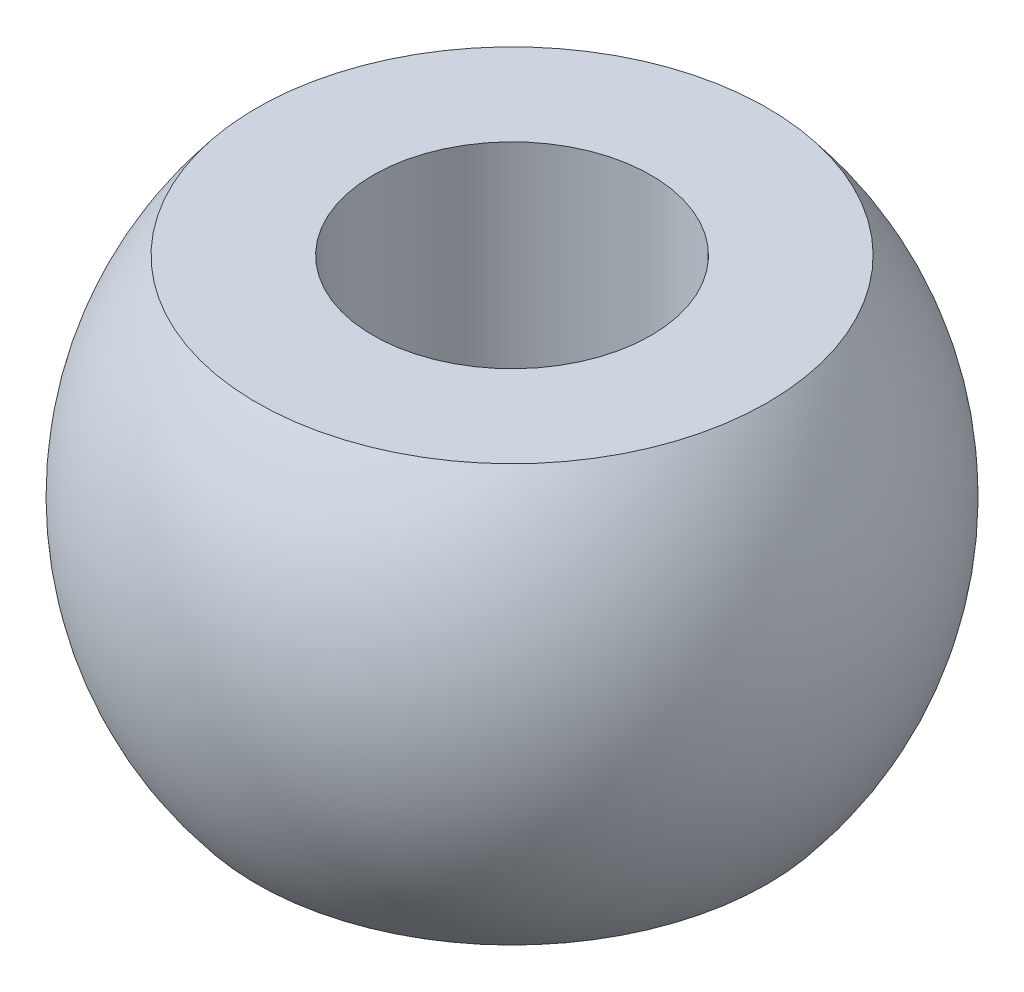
ISO-10303-21;
HEADER;
FILE_DESCRIPTION(('STEP AP214'),'2;1');
FILE_NAME('part.step','',(''),(''),'','','');
FILE_SCHEMA(('AUTOMOTIVE_DESIGN { 1 0 10303 214 1 1 1 1 }'));
ENDSEC;
DATA;
#1=APPLICATION_CONTEXT('core data for automotive mechanical design processes');
#2=APPLICATION_PROTOCOL_DEFINITION('international standard','automotive_design',2000,#1);
#3=PRODUCT_CONTEXT('',#1,'mechanical');
#4=PRODUCT('Part','Part','',(#3));
#5=PRODUCT_RELATED_PRODUCT_CATEGORY('part','',(#4));
#6=PRODUCT_DEFINITION_FORMATION('','',#4);
#7=PRODUCT_DEFINITION_CONTEXT('part definition',#1,'design');
#8=PRODUCT_DEFINITION('design','',#6,#7);
#9=PRODUCT_DEFINITION_SHAPE('','',#8);
#10=(LENGTH_UNIT() NAMED_UNIT(*) SI_UNIT(.MILLI.,.METRE.));
#11=(NAMED_UNIT(*) PLANE_ANGLE_UNIT() SI_UNIT($,.RADIAN.));
#12=(NAMED_UNIT(*) SI_UNIT($,.STERADIAN.) SOLID_ANGLE_UNIT());
#13=UNCERTAINTY_MEASURE_WITH_UNIT(LENGTH_MEASURE(1.E-05),#10,'distance_accuracy_value','');
#14=(GEOMETRIC_REPRESENTATION_CONTEXT(3) GLOBAL_UNCERTAINTY_ASSIGNED_CONTEXT((#13)) GLOBAL_UNIT_ASSIGNED_CONTEXT((#10,
#11,#12)) REPRESENTATION_CONTEXT('',''));
#15=CARTESIAN_POINT('',(0.,0.,0.));
#16=DIRECTION('',(0.,0.,1.));
#17=DIRECTION('',(1.,0.,0.));
#18=AXIS2_PLACEMENT_3D('',#15,#16,#17);
#19=CARTESIAN_POINT('',(3.175,4.7625,0.));
#20=DIRECTION('',(0.,-1.,0.));
#21=DIRECTION('',(1.,0.,0.));
#22=AXIS2_PLACEMENT_3D('',#19,#20,#21);
#23=PLANE('',#22);
#24=CARTESIAN_POINT('',(0.,4.7625,0.));
#25=DIRECTION('',(0.,1.,0.));
#26=DIRECTION('',(-1.,0.,0.));
#27=AXIS2_PLACEMENT_3D('',#24,#25,#26);
#28=CIRCLE('',#27,3.17500000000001);
#29=CARTESIAN_POINT('',(-3.17500000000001,4.7625,0.));
#30=VERTEX_POINT('',#29);
#31=EDGE_CURVE('E10',#30,#30,#28,.T.);
#32=ORIENTED_EDGE('',*,*,#31,.F.);
#33=EDGE_LOOP('',(#32));
#34=FACE_BOUND('',#33,.T.);
#35=CARTESIAN_POINT('',(0.,4.7625,0.));
#36=DIRECTION('',(0.,1.,0.));
#37=DIRECTION('',(-1.,0.,0.));
#38=AXIS2_PLACEMENT_3D('',#35,#36,#37);
#39=CIRCLE('',#38,5.83404327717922);
#40=CARTESIAN_POINT('',(5.83404327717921,4.7625,0.));
#41=VERTEX_POINT('',#40);
#42=EDGE_CURVE('E46',#41,#41,#39,.T.);
#43=ORIENTED_EDGE('',*,*,#42,.T.);
#44=EDGE_LOOP('',(#43));
#45=FACE_BOUND('',#44,.T.);
#46=ADVANCED_FACE('F32',(#34,#45),#23,.F.);
#47=CARTESIAN_POINT('',(0.,21.5066934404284,0.));
#48=DIRECTION('',(0.,1.,0.));
#49=DIRECTION('',(-1.,0.,0.));
#50=AXIS2_PLACEMENT_3D('',#47,#48,#49);
#51=CYLINDRICAL_SURFACE('',#50,3.17500000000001);
#52=CARTESIAN_POINT('',(0.,-4.7625,0.));
#53=DIRECTION('',(0.,1.,0.));
#54=DIRECTION('',(-1.,0.,0.));
#55=AXIS2_PLACEMENT_3D('',#52,#53,#54);
#56=CIRCLE('',#55,3.17500000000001);
#57=CARTESIAN_POINT('',(-3.17500000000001,-4.7625,0.));
#58=VERTEX_POINT('',#57);
#59=EDGE_CURVE('E38',#58,#58,#56,.T.);
#60=ORIENTED_EDGE('',*,*,#59,.F.);
#61=EDGE_LOOP('',(#60));
#62=FACE_BOUND('',#61,.T.);
#63=ORIENTED_EDGE('',*,*,#31,.T.);
#64=EDGE_LOOP('',(#63));
#65=FACE_BOUND('',#64,.T.);
#66=ADVANCED_FACE('F61',(#62,#65),#51,.F.);
#67=CARTESIAN_POINT('',(3.175,-4.7625,0.));
#68=DIRECTION('',(0.,1.,0.));
#69=DIRECTION('',(-1.,0.,0.));
#70=AXIS2_PLACEMENT_3D('',#67,#68,#69);
#71=PLANE('',#70);
#72=CARTESIAN_POINT('',(0.,-4.7625,0.));
#73=DIRECTION('',(0.,1.,0.));
#74=DIRECTION('',(-1.,0.,0.));
#75=AXIS2_PLACEMENT_3D('',#72,#73,#74);
#76=CIRCLE('',#75,5.83404327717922);
#77=CARTESIAN_POINT('',(5.83404327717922,-4.7625,0.));
#78=VERTEX_POINT('',#77);
#79=EDGE_CURVE('E42',#78,#78,#76,.T.);
#80=ORIENTED_EDGE('',*,*,#79,.F.);
#81=EDGE_LOOP('',(#80));
#82=FACE_BOUND('',#81,.T.);
#83=ORIENTED_EDGE('',*,*,#59,.T.);
#84=EDGE_LOOP('',(#83));
#85=FACE_BOUND('',#84,.T.);
#86=ADVANCED_FACE('F56',(#82,#85),#71,.F.);
#87=CARTESIAN_POINT('',(0.,0.,0.));
#88=DIRECTION('',(0.,1.,0.));
#89=DIRECTION('',(1.,0.,0.));
#90=AXIS2_PLACEMENT_3D('',#87,#88,#89);
#91=SPHERICAL_SURFACE('',#90,7.5311);
#92=CARTESIAN_POINT('',(5.83404327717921,4.7625,0.));
#93=CARTESIAN_POINT('',(5.90197150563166,4.67929058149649,0.));
#94=CARTESIAN_POINT('',(5.96811713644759,4.59462612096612,0.));
#95=CARTESIAN_POINT('',(6.09672743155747,4.42254607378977,0.));
#96=CARTESIAN_POINT('',(6.15919209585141,4.33513048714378,0.));
#97=CARTESIAN_POINT('',(6.28032468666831,4.15770714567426,0.));
#98=CARTESIAN_POINT('',(6.33899261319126,4.06769939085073,0.));
#99=CARTESIAN_POINT('',(6.45242471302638,3.88525676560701,0.));
#100=CARTESIAN_POINT('',(6.50718888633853,3.79282189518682,0.));
#101=CARTESIAN_POINT('',(6.61271312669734,3.60569417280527,0.));
#102=CARTESIAN_POINT('',(6.663473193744,3.51100132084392,0.));
#103=CARTESIAN_POINT('',(6.76089632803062,3.31953099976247,0.));
#104=CARTESIAN_POINT('',(6.80755939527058,3.22275353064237,0.));
#105=CARTESIAN_POINT('',(6.89670310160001,3.02729112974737,0.));
#106=CARTESIAN_POINT('',(6.93918374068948,2.92860619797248,0.));
#107=CARTESIAN_POINT('',(7.01988482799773,2.7295095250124,0.));
#108=CARTESIAN_POINT('',(7.05810527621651,2.62909778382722,0.));
#109=CARTESIAN_POINT('',(7.13021601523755,2.42673130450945,0.));
#110=CARTESIAN_POINT('',(7.16410630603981,2.32477656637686,0.));
#111=CARTESIAN_POINT('',(7.22749469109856,2.11951073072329,0.));
#112=CARTESIAN_POINT('',(7.25699278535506,2.01619963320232,0.));
#113=CARTESIAN_POINT('',(7.31154277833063,1.80841019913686,0.));
#114=CARTESIAN_POINT('',(7.33659467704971,1.70393186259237,0.));
#115=CARTESIAN_POINT('',(7.38220641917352,1.49399920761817,0.));
#116=CARTESIAN_POINT('',(7.40276626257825,1.38854488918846,0.));
#117=CARTESIAN_POINT('',(7.43935625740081,1.17685331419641,0.));
#118=CARTESIAN_POINT('',(7.45538640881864,1.07061605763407,0.));
#119=CARTESIAN_POINT('',(7.4828876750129,0.857553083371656,0.));
#120=CARTESIAN_POINT('',(7.49435878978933,0.750727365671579,0.));
#121=CARTESIAN_POINT('',(7.51272098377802,0.5366830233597,0.));
#122=CARTESIAN_POINT('',(7.51961206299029,0.429464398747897,0.));
#123=CARTESIAN_POINT('',(7.52880157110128,0.21483051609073,0.));
#124=CARTESIAN_POINT('',(7.5311,0.107415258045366,0.));
#125=CARTESIAN_POINT('',(7.5311,-0.107415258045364,0.));
#126=CARTESIAN_POINT('',(7.52880157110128,-0.214830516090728,0.));
#127=CARTESIAN_POINT('',(7.51961206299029,-0.429464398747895,0.));
#128=CARTESIAN_POINT('',(7.51272098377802,-0.536683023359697,0.));
#129=CARTESIAN_POINT('',(7.49435878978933,-0.750727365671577,0.));
#130=CARTESIAN_POINT('',(7.4828876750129,-0.857553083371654,0.));
#131=CARTESIAN_POINT('',(7.45538640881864,-1.07061605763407,0.));
#132=CARTESIAN_POINT('',(7.43935625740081,-1.17685331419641,0.));
#133=CARTESIAN_POINT('',(7.40276626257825,-1.38854488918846,0.));
#134=CARTESIAN_POINT('',(7.38220641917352,-1.49399920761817,0.));
#135=CARTESIAN_POINT('',(7.33659467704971,-1.70393186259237,0.));
#136=CARTESIAN_POINT('',(7.31154277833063,-1.80841019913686,0.));
#137=CARTESIAN_POINT('',(7.25699278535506,-2.01619963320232,0.));
#138=CARTESIAN_POINT('',(7.22749469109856,-2.11951073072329,0.));
#139=CARTESIAN_POINT('',(7.16410630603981,-2.32477656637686,0.));
#140=CARTESIAN_POINT('',(7.13021601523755,-2.42673130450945,0.));
#141=CARTESIAN_POINT('',(7.05810527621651,-2.62909778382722,0.));
#142=CARTESIAN_POINT('',(7.01988482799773,-2.7295095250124,0.));
#143=CARTESIAN_POINT('',(6.93918374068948,-2.92860619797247,0.));
#144=CARTESIAN_POINT('',(6.89670310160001,-3.02729112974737,0.));
#145=CARTESIAN_POINT('',(6.80755939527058,-3.22275353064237,0.));
#146=CARTESIAN_POINT('',(6.76089632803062,-3.31953099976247,0.));
#147=CARTESIAN_POINT('',(6.663473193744,-3.51100132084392,0.));
#148=CARTESIAN_POINT('',(6.61271312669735,-3.60569417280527,0.));
#149=CARTESIAN_POINT('',(6.50718888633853,-3.79282189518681,0.));
#150=CARTESIAN_POINT('',(6.45242471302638,-3.88525676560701,0.));
#151=CARTESIAN_POINT('',(6.33899261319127,-4.06769939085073,0.));
#152=CARTESIAN_POINT('',(6.28032468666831,-4.15770714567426,0.));
#153=CARTESIAN_POINT('',(6.15919209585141,-4.33513048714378,0.));
#154=CARTESIAN_POINT('',(6.09672743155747,-4.42254607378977,0.));
#155=CARTESIAN_POINT('',(5.96811713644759,-4.59462612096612,0.));
#156=CARTESIAN_POINT('',(5.90197150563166,-4.67929058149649,0.));
#157=CARTESIAN_POINT('',(5.83404327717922,-4.7625,0.));
#158=B_SPLINE_CURVE_WITH_KNOTS('',3,(#92,#93,#94,#95,#96,#97,#98,#99,#100,#101,#102,#103,#104,
#105,#106,#107,#108,#109,#110,#111,#112,#113,#114,#115,#116,#117,#118,#119,#120,#121,#122,#123,
#124,#125,#126,#127,#128,#129,#130,#131,#132,#133,#134,#135,#136,#137,#138,#139,#140,#141,#142,
#143,#144,#145,#146,#147,#148,#149,#150,#151,#152,#153,#154,#155,#156,#157),.UNSPECIFIED.,.F.,
.F.,(4,2,2,2,2,2,2,2,2,2,2,2,2,2,2,2,2,2,2,2,2,2,2,2,2,2,2,2,2,2,2,2,4),(0.,0.322221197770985,
0.644442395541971,0.966663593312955,1.28888479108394,1.61110598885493,1.93332718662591,
2.2555483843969,2.57776958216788,2.89999077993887,3.22221197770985,3.54443317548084,
3.86665437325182,4.18887557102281,4.51109676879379,4.83331796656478,5.15553916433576,
5.47776036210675,5.79998155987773,6.12220275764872,6.4444239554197,6.76664515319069,
7.08886635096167,7.41108754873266,7.73330874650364,8.05552994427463,8.37775114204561,
8.6999723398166,9.02219353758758,9.34441473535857,9.66663593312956,9.98885713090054,
10.3110783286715),.UNSPECIFIED.);
#159=EDGE_CURVE('BSEAM53',#41,#78,#158,.T.);
#160=ORIENTED_EDGE('',*,*,#42,.F.);
#161=ORIENTED_EDGE('',*,*,#79,.T.);
#162=ORIENTED_EDGE('',*,*,#159,.T.);
#163=ORIENTED_EDGE('',*,*,#159,.F.);
#164=EDGE_LOOP('',(#160,#162,#161,#163));
#165=FACE_BOUND('',#164,.T.);
#166=ADVANCED_FACE('F53',(#165),#91,.T.);
#167=CLOSED_SHELL('',(#46,#66,#86,#166));
#168=MANIFOLD_SOLID_BREP('B2',#167);
#169=ADVANCED_BREP_SHAPE_REPRESENTATION('',(#18,#168),#14);
#170=SHAPE_DEFINITION_REPRESENTATION(#9,#169);
ENDSEC;
END-ISO-10303-21;
